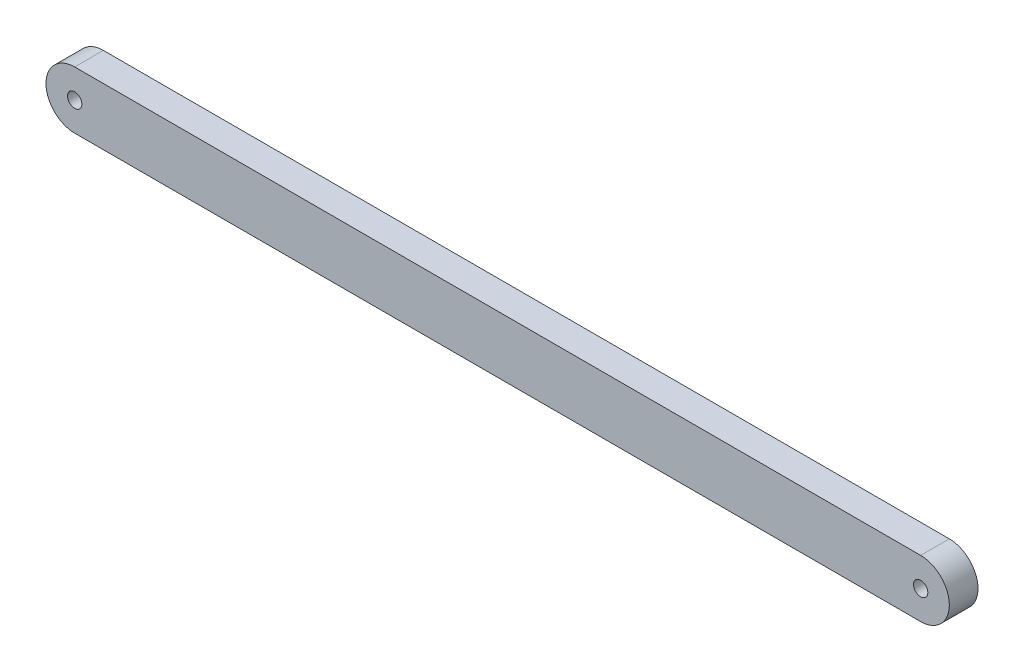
from build123d import *

# Parameters (mm, degrees)
BOSS_EXTRUDE1_DEPTH = 2.54
SKETCH2_R           = 0.635
CUT_EXTRUDE1_DEPTH  = 78.553233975


with BuildPart() as part:
    # Sketch1 → Boss-Extrude1 (new body)
    with BuildSketch(Plane.XY):
        with BuildLine():
            Line((0, 2.54), (74.93, 2.54))
            ThreePointArc((74.93, 2.54), (77.47, 0), (74.93, -2.54))
            Line((74.93, -2.54), (0, -2.54))
            ThreePointArc((0, -2.54), (-2.54, 0), (0, 2.54))
        make_face()
    extrude(amount=BOSS_EXTRUDE1_DEPTH)

    # Sketch2 → Cut-Extrude1 (cut, symmetric)
    with BuildSketch(Plane.XY.offset(2.54)):
        Circle(SKETCH2_R)
    cut_extrude1 = extrude(amount=CUT_EXTRUDE1_DEPTH, both=True, mode=Mode.SUBTRACT)

    # Mirror1: Cut-Extrude1 across plane
    add(cut_extrude1.mirror(Plane(origin=(37.465, 0, 0), x_dir=(0, 0, 1), z_dir=(1, 0, 0))), mode=Mode.SUBTRACT)


solid = part.part
